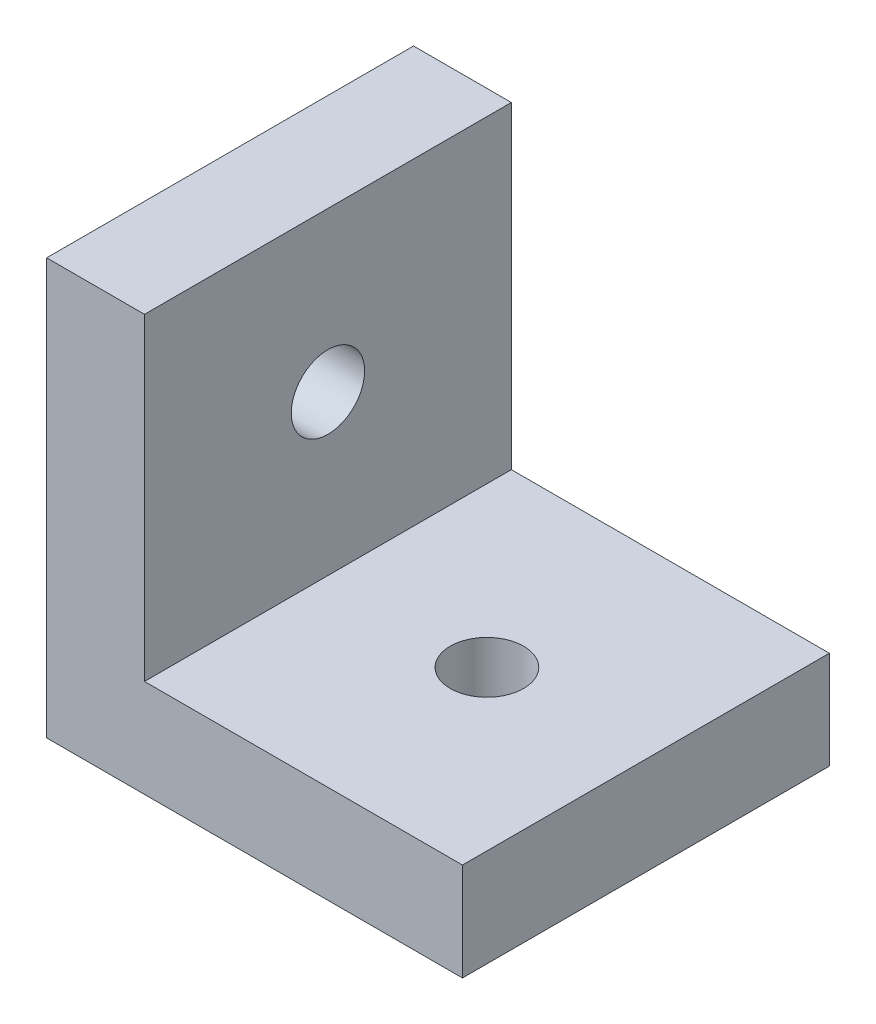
ISO-10303-21;
HEADER;
FILE_DESCRIPTION(('STEP AP214'),'2;1');
FILE_NAME('part.step','',(''),(''),'','','');
FILE_SCHEMA(('AUTOMOTIVE_DESIGN { 1 0 10303 214 1 1 1 1 }'));
ENDSEC;
DATA;
#1=APPLICATION_CONTEXT('core data for automotive mechanical design processes');
#2=APPLICATION_PROTOCOL_DEFINITION('international standard','automotive_design',2000,#1);
#3=PRODUCT_CONTEXT('',#1,'mechanical');
#4=PRODUCT('Part','Part','',(#3));
#5=PRODUCT_RELATED_PRODUCT_CATEGORY('part','',(#4));
#6=PRODUCT_DEFINITION_FORMATION('','',#4);
#7=PRODUCT_DEFINITION_CONTEXT('part definition',#1,'design');
#8=PRODUCT_DEFINITION('design','',#6,#7);
#9=PRODUCT_DEFINITION_SHAPE('','',#8);
#10=(LENGTH_UNIT() NAMED_UNIT(*) SI_UNIT(.MILLI.,.METRE.));
#11=(NAMED_UNIT(*) PLANE_ANGLE_UNIT() SI_UNIT($,.RADIAN.));
#12=(NAMED_UNIT(*) SI_UNIT($,.STERADIAN.) SOLID_ANGLE_UNIT());
#13=UNCERTAINTY_MEASURE_WITH_UNIT(LENGTH_MEASURE(1.E-05),#10,'distance_accuracy_value','');
#14=(GEOMETRIC_REPRESENTATION_CONTEXT(3) GLOBAL_UNCERTAINTY_ASSIGNED_CONTEXT((#13)) GLOBAL_UNIT_ASSIGNED_CONTEXT((#10,
#11,#12)) REPRESENTATION_CONTEXT('',''));
#15=CARTESIAN_POINT('',(0.,0.,0.));
#16=DIRECTION('',(0.,0.,1.));
#17=DIRECTION('',(1.,0.,0.));
#18=AXIS2_PLACEMENT_3D('',#15,#16,#17);
#19=CARTESIAN_POINT('',(0.,0.,15.));
#20=DIRECTION('',(1.,0.,0.));
#21=DIRECTION('',(0.,0.,-1.));
#22=AXIS2_PLACEMENT_3D('',#19,#20,#21);
#23=PLANE('',#22);
#24=CARTESIAN_POINT('',(0.,10.5,7.5));
#25=DIRECTION('',(1.,0.,0.));
#26=DIRECTION('',(0.,0.,-1.));
#27=AXIS2_PLACEMENT_3D('',#24,#25,#26);
#28=CIRCLE('',#27,1.5);
#29=CARTESIAN_POINT('',(0.,10.5,6.));
#30=VERTEX_POINT('',#29);
#31=EDGE_CURVE('E120',#30,#30,#28,.T.);
#32=ORIENTED_EDGE('',*,*,#31,.T.);
#33=EDGE_LOOP('',(#32));
#34=FACE_BOUND('',#33,.T.);
#35=DIRECTION('',(0.,-1.,0.));
#36=VECTOR('',#35,1.);
#37=CARTESIAN_POINT('',(0.,0.,0.));
#38=LINE('',#37,#36);
#39=CARTESIAN_POINT('',(0.,17.,0.));
#40=VERTEX_POINT('',#39);
#41=CARTESIAN_POINT('',(0.,0.,0.));
#42=VERTEX_POINT('',#41);
#43=EDGE_CURVE('E116',#40,#42,#38,.T.);
#44=ORIENTED_EDGE('',*,*,#43,.T.);
#45=DIRECTION('',(0.,0.,-1.));
#46=VECTOR('',#45,1.);
#47=CARTESIAN_POINT('',(0.,0.,15.));
#48=LINE('',#47,#46);
#49=CARTESIAN_POINT('',(0.,0.,15.));
#50=VERTEX_POINT('',#49);
#51=EDGE_CURVE('E11',#50,#42,#48,.T.);
#52=ORIENTED_EDGE('',*,*,#51,.F.);
#53=DIRECTION('',(0.,-1.,0.));
#54=VECTOR('',#53,1.);
#55=CARTESIAN_POINT('',(0.,0.,15.));
#56=LINE('',#55,#54);
#57=CARTESIAN_POINT('',(0.,17.,15.));
#58=VERTEX_POINT('',#57);
#59=EDGE_CURVE('E127',#58,#50,#56,.T.);
#60=ORIENTED_EDGE('',*,*,#59,.F.);
#61=DIRECTION('',(0.,0.,-1.));
#62=VECTOR('',#61,1.);
#63=CARTESIAN_POINT('',(0.,17.,15.));
#64=LINE('',#63,#62);
#65=EDGE_CURVE('E112',#58,#40,#64,.T.);
#66=ORIENTED_EDGE('',*,*,#65,.T.);
#67=EDGE_LOOP('',(#44,#52,#60,#66));
#68=FACE_BOUND('',#67,.T.);
#69=ADVANCED_FACE('F32',(#34,#68),#23,.F.);
#70=CARTESIAN_POINT('',(0.,0.,15.));
#71=DIRECTION('',(0.,1.,0.));
#72=DIRECTION('',(0.,0.,1.));
#73=AXIS2_PLACEMENT_3D('',#70,#71,#72);
#74=PLANE('',#73);
#75=CARTESIAN_POINT('',(10.5,0.,7.5));
#76=DIRECTION('',(0.,1.,0.));
#77=DIRECTION('',(0.,0.,1.));
#78=AXIS2_PLACEMENT_3D('',#75,#76,#77);
#79=CIRCLE('',#78,1.5);
#80=CARTESIAN_POINT('',(10.5,0.,9.));
#81=VERTEX_POINT('',#80);
#82=EDGE_CURVE('E164',#81,#81,#79,.T.);
#83=ORIENTED_EDGE('',*,*,#82,.T.);
#84=EDGE_LOOP('',(#83));
#85=FACE_BOUND('',#84,.T.);
#86=DIRECTION('',(1.,0.,0.));
#87=VECTOR('',#86,1.);
#88=CARTESIAN_POINT('',(0.,0.,0.));
#89=LINE('',#88,#87);
#90=CARTESIAN_POINT('',(17.,0.,0.));
#91=VERTEX_POINT('',#90);
#92=EDGE_CURVE('E119',#42,#91,#89,.T.);
#93=ORIENTED_EDGE('',*,*,#92,.T.);
#94=DIRECTION('',(0.,0.,-1.));
#95=VECTOR('',#94,1.);
#96=CARTESIAN_POINT('',(17.,0.,15.));
#97=LINE('',#96,#95);
#98=CARTESIAN_POINT('',(17.,0.,15.));
#99=VERTEX_POINT('',#98);
#100=EDGE_CURVE('E40',#99,#91,#97,.T.);
#101=ORIENTED_EDGE('',*,*,#100,.F.);
#102=DIRECTION('',(1.,0.,0.));
#103=VECTOR('',#102,1.);
#104=CARTESIAN_POINT('',(0.,0.,15.));
#105=LINE('',#104,#103);
#106=EDGE_CURVE('E85',#50,#99,#105,.T.);
#107=ORIENTED_EDGE('',*,*,#106,.F.);
#108=ORIENTED_EDGE('',*,*,#51,.T.);
#109=EDGE_LOOP('',(#93,#101,#107,#108));
#110=FACE_BOUND('',#109,.T.);
#111=ADVANCED_FACE('F152',(#85,#110),#74,.F.);
#112=CARTESIAN_POINT('',(17.,0.,15.));
#113=DIRECTION('',(-1.,0.,0.));
#114=DIRECTION('',(0.,0.,1.));
#115=AXIS2_PLACEMENT_3D('',#112,#113,#114);
#116=PLANE('',#115);
#117=DIRECTION('',(0.,1.,0.));
#118=VECTOR('',#117,1.);
#119=CARTESIAN_POINT('',(17.,0.,0.));
#120=LINE('',#119,#118);
#121=CARTESIAN_POINT('',(17.,4.,0.));
#122=VERTEX_POINT('',#121);
#123=EDGE_CURVE('E122',#91,#122,#120,.T.);
#124=ORIENTED_EDGE('',*,*,#123,.T.);
#125=DIRECTION('',(0.,0.,-1.));
#126=VECTOR('',#125,1.);
#127=CARTESIAN_POINT('',(17.,4.,15.));
#128=LINE('',#127,#126);
#129=CARTESIAN_POINT('',(17.,4.,15.));
#130=VERTEX_POINT('',#129);
#131=EDGE_CURVE('E107',#130,#122,#128,.T.);
#132=ORIENTED_EDGE('',*,*,#131,.F.);
#133=DIRECTION('',(0.,1.,0.));
#134=VECTOR('',#133,1.);
#135=CARTESIAN_POINT('',(17.,0.,15.));
#136=LINE('',#135,#134);
#137=EDGE_CURVE('E98',#99,#130,#136,.T.);
#138=ORIENTED_EDGE('',*,*,#137,.F.);
#139=ORIENTED_EDGE('',*,*,#100,.T.);
#140=EDGE_LOOP('',(#124,#132,#138,#139));
#141=FACE_BOUND('',#140,.T.);
#142=ADVANCED_FACE('F133',(#141),#116,.F.);
#143=CARTESIAN_POINT('',(4.,4.,15.));
#144=DIRECTION('',(0.,-1.,0.));
#145=DIRECTION('',(0.,0.,-1.));
#146=AXIS2_PLACEMENT_3D('',#143,#144,#145);
#147=PLANE('',#146);
#148=CARTESIAN_POINT('',(10.5,4.,7.5));
#149=DIRECTION('',(0.,1.,0.));
#150=DIRECTION('',(0.,0.,1.));
#151=AXIS2_PLACEMENT_3D('',#148,#149,#150);
#152=CIRCLE('',#151,1.5);
#153=CARTESIAN_POINT('',(10.5,4.,9.));
#154=VERTEX_POINT('',#153);
#155=EDGE_CURVE('E171',#154,#154,#152,.T.);
#156=ORIENTED_EDGE('',*,*,#155,.F.);
#157=EDGE_LOOP('',(#156));
#158=FACE_BOUND('',#157,.T.);
#159=DIRECTION('',(-1.,0.,0.));
#160=VECTOR('',#159,1.);
#161=CARTESIAN_POINT('',(4.,4.,0.));
#162=LINE('',#161,#160);
#163=CARTESIAN_POINT('',(4.,4.,0.));
#164=VERTEX_POINT('',#163);
#165=EDGE_CURVE('E106',#122,#164,#162,.T.);
#166=ORIENTED_EDGE('',*,*,#165,.T.);
#167=DIRECTION('',(0.,0.,-1.));
#168=VECTOR('',#167,1.);
#169=CARTESIAN_POINT('',(4.,4.,15.));
#170=LINE('',#169,#168);
#171=CARTESIAN_POINT('',(4.,4.,15.));
#172=VERTEX_POINT('',#171);
#173=EDGE_CURVE('E103',#172,#164,#170,.T.);
#174=ORIENTED_EDGE('',*,*,#173,.F.);
#175=DIRECTION('',(-1.,0.,0.));
#176=VECTOR('',#175,1.);
#177=CARTESIAN_POINT('',(4.,4.,15.));
#178=LINE('',#177,#176);
#179=EDGE_CURVE('E92',#130,#172,#178,.T.);
#180=ORIENTED_EDGE('',*,*,#179,.F.);
#181=ORIENTED_EDGE('',*,*,#131,.T.);
#182=EDGE_LOOP('',(#166,#174,#180,#181));
#183=FACE_BOUND('',#182,.T.);
#184=ADVANCED_FACE('F104',(#158,#183),#147,.F.);
#185=CARTESIAN_POINT('',(4.,17.,15.));
#186=DIRECTION('',(-1.,0.,0.));
#187=DIRECTION('',(0.,0.,1.));
#188=AXIS2_PLACEMENT_3D('',#185,#186,#187);
#189=PLANE('',#188);
#190=CARTESIAN_POINT('',(4.,10.5,7.5));
#191=DIRECTION('',(1.,0.,0.));
#192=DIRECTION('',(0.,0.,-1.));
#193=AXIS2_PLACEMENT_3D('',#190,#191,#192);
#194=CIRCLE('',#193,1.5);
#195=CARTESIAN_POINT('',(4.,10.5,6.));
#196=VERTEX_POINT('',#195);
#197=EDGE_CURVE('E161',#196,#196,#194,.T.);
#198=ORIENTED_EDGE('',*,*,#197,.F.);
#199=EDGE_LOOP('',(#198));
#200=FACE_BOUND('',#199,.T.);
#201=DIRECTION('',(0.,1.,0.));
#202=VECTOR('',#201,1.);
#203=CARTESIAN_POINT('',(4.,17.,0.));
#204=LINE('',#203,#202);
#205=CARTESIAN_POINT('',(4.,17.,0.));
#206=VERTEX_POINT('',#205);
#207=EDGE_CURVE('E71',#164,#206,#204,.T.);
#208=ORIENTED_EDGE('',*,*,#207,.T.);
#209=DIRECTION('',(0.,0.,-1.));
#210=VECTOR('',#209,1.);
#211=CARTESIAN_POINT('',(4.,17.,15.));
#212=LINE('',#211,#210);
#213=CARTESIAN_POINT('',(4.,17.,15.));
#214=VERTEX_POINT('',#213);
#215=EDGE_CURVE('E108',#214,#206,#212,.T.);
#216=ORIENTED_EDGE('',*,*,#215,.F.);
#217=DIRECTION('',(0.,1.,0.));
#218=VECTOR('',#217,1.);
#219=CARTESIAN_POINT('',(4.,17.,15.));
#220=LINE('',#219,#218);
#221=EDGE_CURVE('E96',#172,#214,#220,.T.);
#222=ORIENTED_EDGE('',*,*,#221,.F.);
#223=ORIENTED_EDGE('',*,*,#173,.T.);
#224=EDGE_LOOP('',(#208,#216,#222,#223));
#225=FACE_BOUND('',#224,.T.);
#226=ADVANCED_FACE('F110',(#200,#225),#189,.F.);
#227=CARTESIAN_POINT('',(0.,17.,15.));
#228=DIRECTION('',(0.,-1.,0.));
#229=DIRECTION('',(0.,0.,-1.));
#230=AXIS2_PLACEMENT_3D('',#227,#228,#229);
#231=PLANE('',#230);
#232=DIRECTION('',(-1.,0.,0.));
#233=VECTOR('',#232,1.);
#234=CARTESIAN_POINT('',(0.,17.,0.));
#235=LINE('',#234,#233);
#236=EDGE_CURVE('E77',#206,#40,#235,.T.);
#237=ORIENTED_EDGE('',*,*,#236,.T.);
#238=ORIENTED_EDGE('',*,*,#65,.F.);
#239=DIRECTION('',(-1.,0.,0.));
#240=VECTOR('',#239,1.);
#241=CARTESIAN_POINT('',(0.,17.,15.));
#242=LINE('',#241,#240);
#243=EDGE_CURVE('E48',#214,#58,#242,.T.);
#244=ORIENTED_EDGE('',*,*,#243,.F.);
#245=ORIENTED_EDGE('',*,*,#215,.T.);
#246=EDGE_LOOP('',(#237,#238,#244,#245));
#247=FACE_BOUND('',#246,.T.);
#248=ADVANCED_FACE('F140',(#247),#231,.F.);
#249=CARTESIAN_POINT('',(0.,0.,15.));
#250=DIRECTION('',(0.,0.,-1.));
#251=DIRECTION('',(-1.,0.,0.));
#252=AXIS2_PLACEMENT_3D('',#249,#250,#251);
#253=PLANE('',#252);
#254=ORIENTED_EDGE('',*,*,#59,.T.);
#255=ORIENTED_EDGE('',*,*,#106,.T.);
#256=ORIENTED_EDGE('',*,*,#137,.T.);
#257=ORIENTED_EDGE('',*,*,#179,.T.);
#258=ORIENTED_EDGE('',*,*,#221,.T.);
#259=ORIENTED_EDGE('',*,*,#243,.T.);
#260=EDGE_LOOP('',(#254,#255,#256,#257,#258,#259));
#261=FACE_BOUND('',#260,.T.);
#262=ADVANCED_FACE('F94',(#261),#253,.F.);
#263=CARTESIAN_POINT('',(0.,0.,0.));
#264=DIRECTION('',(0.,0.,-1.));
#265=DIRECTION('',(-1.,0.,0.));
#266=AXIS2_PLACEMENT_3D('',#263,#264,#265);
#267=PLANE('',#266);
#268=ORIENTED_EDGE('',*,*,#43,.F.);
#269=ORIENTED_EDGE('',*,*,#236,.F.);
#270=ORIENTED_EDGE('',*,*,#207,.F.);
#271=ORIENTED_EDGE('',*,*,#165,.F.);
#272=ORIENTED_EDGE('',*,*,#123,.F.);
#273=ORIENTED_EDGE('',*,*,#92,.F.);
#274=EDGE_LOOP('',(#268,#269,#270,#271,#272,#273));
#275=FACE_BOUND('',#274,.T.);
#276=ADVANCED_FACE('F136',(#275),#267,.T.);
#277=CARTESIAN_POINT('',(-11.,10.5,7.5));
#278=DIRECTION('',(1.,0.,0.));
#279=DIRECTION('',(0.,0.,-1.));
#280=AXIS2_PLACEMENT_3D('',#277,#278,#279);
#281=CYLINDRICAL_SURFACE('',#280,1.5);
#282=ORIENTED_EDGE('',*,*,#197,.T.);
#283=EDGE_LOOP('',(#282));
#284=FACE_BOUND('',#283,.T.);
#285=ORIENTED_EDGE('',*,*,#31,.F.);
#286=EDGE_LOOP('',(#285));
#287=FACE_BOUND('',#286,.T.);
#288=ADVANCED_FACE('F196',(#284,#287),#281,.F.);
#289=CARTESIAN_POINT('',(10.5,-11.,7.5));
#290=DIRECTION('',(0.,1.,0.));
#291=DIRECTION('',(0.,0.,1.));
#292=AXIS2_PLACEMENT_3D('',#289,#290,#291);
#293=CYLINDRICAL_SURFACE('',#292,1.5);
#294=ORIENTED_EDGE('',*,*,#155,.T.);
#295=EDGE_LOOP('',(#294));
#296=FACE_BOUND('',#295,.T.);
#297=ORIENTED_EDGE('',*,*,#82,.F.);
#298=EDGE_LOOP('',(#297));
#299=FACE_BOUND('',#298,.T.);
#300=ADVANCED_FACE('F175',(#296,#299),#293,.F.);
#301=CLOSED_SHELL('',(#69,#111,#142,#184,#226,#248,#262,#276,#288,#300));
#302=MANIFOLD_SOLID_BREP('B2',#301);
#303=ADVANCED_BREP_SHAPE_REPRESENTATION('',(#18,#302),#14);
#304=SHAPE_DEFINITION_REPRESENTATION(#9,#303);
ENDSEC;
END-ISO-10303-21;
